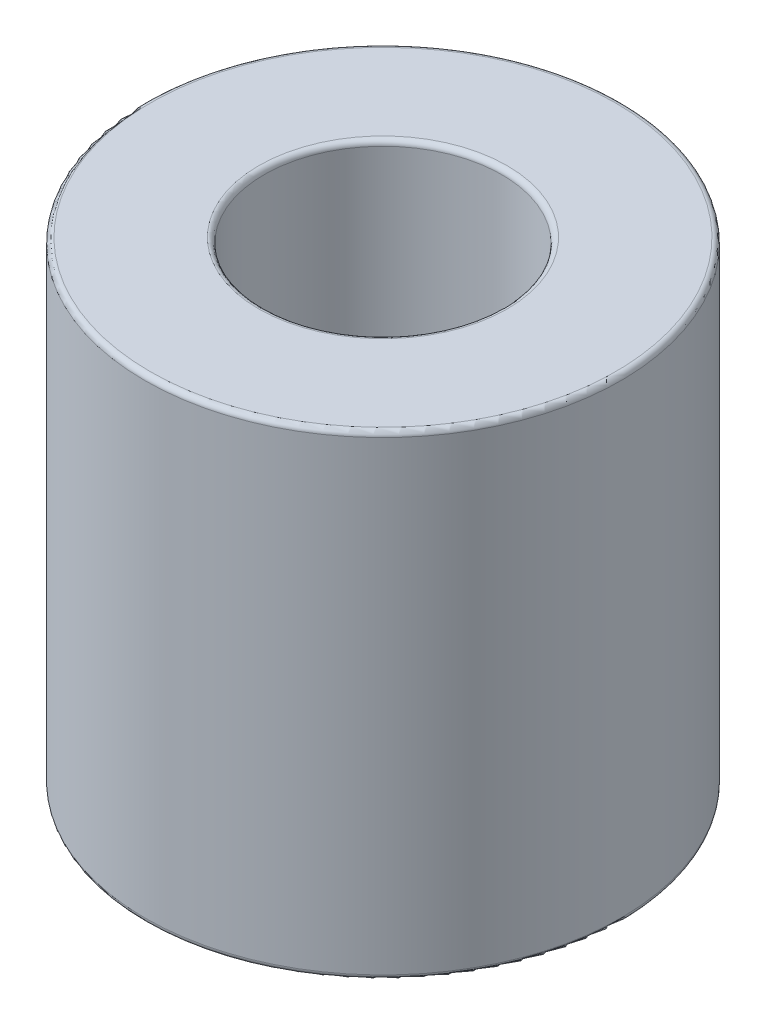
from build123d import *

# Parameters (mm, degrees)
BOSS_EXTRUDE1_DEPTH      = 3.175
BOSS_EXTRUDE1_DEPTH_BACK = 3.175
SKETCH3_R                = 3.175
SKETCH3_R_2              = 1.5875
FILLET2_R                = 0.06985


with BuildPart() as part:
    # Sketch3 → Boss-Extrude1 (new, two sides: drawn at the far end of the back side and taken through both)
    with BuildSketch(Plane(origin=(0, 0, 0), x_dir=(1, 0, 0), z_dir=(0, 1, 0)).offset(-BOSS_EXTRUDE1_DEPTH_BACK)):
        with Locations(Location((0, 0, 0), (0, 0, 270))):
            Circle(SKETCH3_R)
        with Locations(Location((0, 0, 0), (0, 0, 270))):
            Circle(SKETCH3_R_2, mode=Mode.SUBTRACT)
    extrude(amount=BOSS_EXTRUDE1_DEPTH + BOSS_EXTRUDE1_DEPTH_BACK)

    # Fillet2
    fillet2_edges = [part.edges().sort_by_distance(p)[0] for p in [
        (0, -3.175, -3.175),
        (0, -3.175, -1.5875),
        (0, 3.175, -3.175),
        (0, 3.175, -1.5875),
    ]]
    fillet(fillet2_edges, radius=FILLET2_R)


solid = part.part
